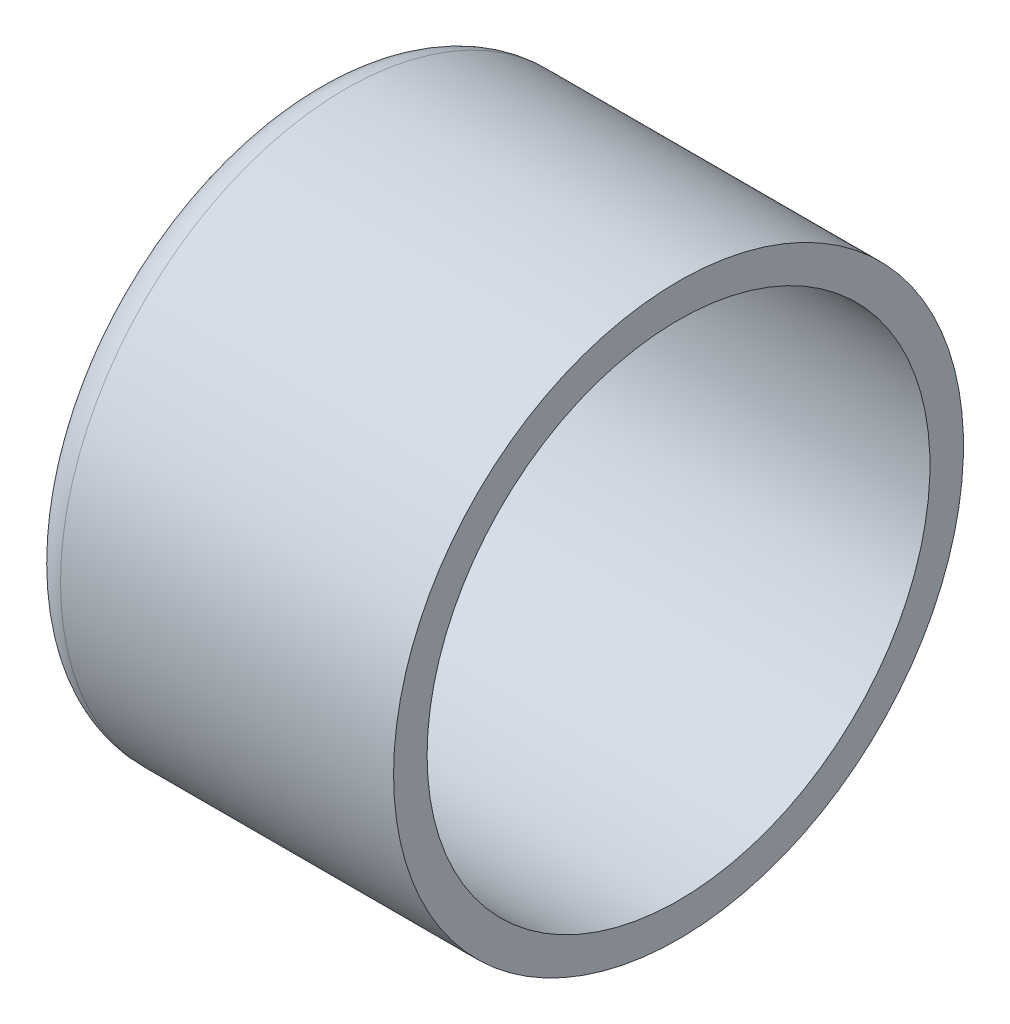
from build123d import *


with BuildPart() as part:
    # Esquisse1 → R_volution1 (revolve)
    with BuildSketch(Plane.XY, mode=Mode.PRIVATE) as r_volution1_sk:
        with BuildLine():
            Line((0, 22.5), (32.8, 22.5))
            Line((32.8, 22.5), (32.8, 25.5))
            Line((32.8, 25.5), (3, 25.5))
            ThreePointArc((3, 25.5), (0.878679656, 24.621320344), (0, 22.5))
        make_face()
    revolve(r_volution1_sk.sketch.rotate(Axis((-12.682650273, 0, 0), (1, 0, 0)), 90), axis=Axis((-12.682650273, 0, 0), (1, 0, 0)))


solid = part.part
